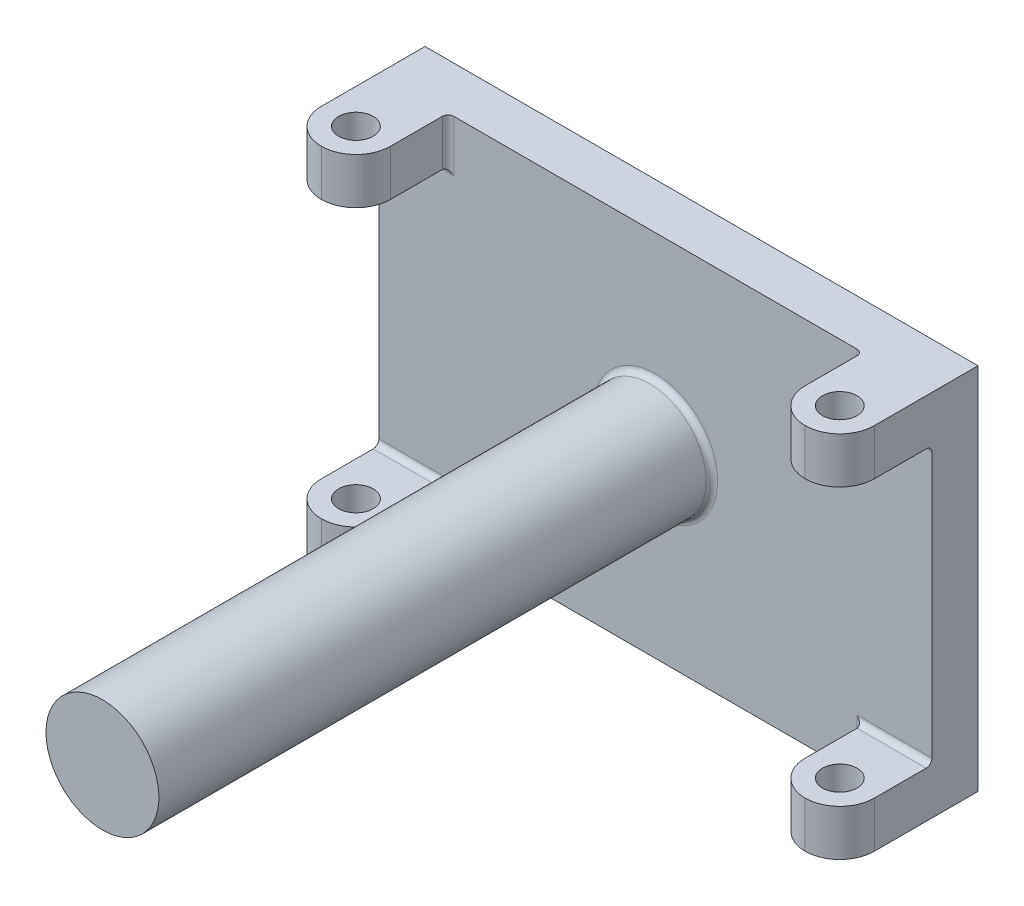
ISO-10303-21;
HEADER;
FILE_DESCRIPTION(('STEP AP214'),'2;1');
FILE_NAME('part.step','',(''),(''),'','','');
FILE_SCHEMA(('AUTOMOTIVE_DESIGN { 1 0 10303 214 1 1 1 1 }'));
ENDSEC;
DATA;
#1=APPLICATION_CONTEXT('core data for automotive mechanical design processes');
#2=APPLICATION_PROTOCOL_DEFINITION('international standard','automotive_design',2000,#1);
#3=PRODUCT_CONTEXT('',#1,'mechanical');
#4=PRODUCT('Part','Part','',(#3));
#5=PRODUCT_RELATED_PRODUCT_CATEGORY('part','',(#4));
#6=PRODUCT_DEFINITION_FORMATION('','',#4);
#7=PRODUCT_DEFINITION_CONTEXT('part definition',#1,'design');
#8=PRODUCT_DEFINITION('design','',#6,#7);
#9=PRODUCT_DEFINITION_SHAPE('','',#8);
#10=(LENGTH_UNIT() NAMED_UNIT(*) SI_UNIT(.MILLI.,.METRE.));
#11=(NAMED_UNIT(*) PLANE_ANGLE_UNIT() SI_UNIT($,.RADIAN.));
#12=(NAMED_UNIT(*) SI_UNIT($,.STERADIAN.) SOLID_ANGLE_UNIT());
#13=UNCERTAINTY_MEASURE_WITH_UNIT(LENGTH_MEASURE(1.E-05),#10,'distance_accuracy_value','');
#14=(GEOMETRIC_REPRESENTATION_CONTEXT(3) GLOBAL_UNCERTAINTY_ASSIGNED_CONTEXT((#13)) GLOBAL_UNIT_ASSIGNED_CONTEXT((#10,
#11,#12)) REPRESENTATION_CONTEXT('',''));
#15=CARTESIAN_POINT('',(0.,0.,0.));
#16=DIRECTION('',(0.,0.,1.));
#17=DIRECTION('',(1.,0.,0.));
#18=AXIS2_PLACEMENT_3D('',#15,#16,#17);
#19=CARTESIAN_POINT('',(-152.4,-101.6,25.4));
#20=DIRECTION('',(0.,0.,-1.));
#21=DIRECTION('',(-1.,0.,0.));
#22=AXIS2_PLACEMENT_3D('',#19,#20,#21);
#23=PLANE('',#22);
#24=CARTESIAN_POINT('',(0.,0.,25.4));
#25=DIRECTION('',(0.,0.,-1.));
#26=DIRECTION('',(-1.,0.,0.));
#27=AXIS2_PLACEMENT_3D('',#24,#25,#26);
#28=CIRCLE('',#27,34.29);
#29=CARTESIAN_POINT('',(-34.29,0.,25.4));
#30=VERTEX_POINT('',#29);
#31=EDGE_CURVE('E386',#30,#30,#28,.T.);
#32=ORIENTED_EDGE('',*,*,#31,.T.);
#33=EDGE_LOOP('',(#32));
#34=FACE_BOUND('',#33,.T.);
#35=DIRECTION('',(0.,1.,0.));
#36=VECTOR('',#35,1.);
#37=CARTESIAN_POINT('',(152.4,-101.6,25.4));
#38=LINE('',#37,#36);
#39=CARTESIAN_POINT('',(152.4,-73.025,25.4));
#40=VERTEX_POINT('',#39);
#41=CARTESIAN_POINT('',(152.4,73.025,25.4));
#42=VERTEX_POINT('',#41);
#43=EDGE_CURVE('E355',#40,#42,#38,.T.);
#44=ORIENTED_EDGE('',*,*,#43,.T.);
#45=DIRECTION('',(1.,0.,0.));
#46=VECTOR('',#45,1.);
#47=CARTESIAN_POINT('',(114.3,73.025,25.4));
#48=LINE('',#47,#46);
#49=CARTESIAN_POINT('',(111.125,73.025,25.4));
#50=VERTEX_POINT('',#49);
#51=EDGE_CURVE('E384',#42,#50,#48,.F.);
#52=ORIENTED_EDGE('',*,*,#51,.T.);
#53=DIRECTION('',(0.,-1.,0.));
#54=VECTOR('',#53,1.);
#55=CARTESIAN_POINT('',(111.125,101.6,25.4));
#56=LINE('',#55,#54);
#57=CARTESIAN_POINT('',(111.125,101.6,25.4));
#58=VERTEX_POINT('',#57);
#59=EDGE_CURVE('E376',#50,#58,#56,.F.);
#60=ORIENTED_EDGE('',*,*,#59,.T.);
#61=DIRECTION('',(-1.,0.,0.));
#62=VECTOR('',#61,1.);
#63=CARTESIAN_POINT('',(-152.4,101.6,25.4));
#64=LINE('',#63,#62);
#65=CARTESIAN_POINT('',(-111.125,101.6,25.4));
#66=VERTEX_POINT('',#65);
#67=EDGE_CURVE('E243',#58,#66,#64,.T.);
#68=ORIENTED_EDGE('',*,*,#67,.T.);
#69=DIRECTION('',(0.,-1.,0.));
#70=VECTOR('',#69,1.);
#71=CARTESIAN_POINT('',(-111.125,-101.6,25.4));
#72=LINE('',#71,#70);
#73=CARTESIAN_POINT('',(-111.125,73.025,25.4));
#74=VERTEX_POINT('',#73);
#75=EDGE_CURVE('E379',#66,#74,#72,.T.);
#76=ORIENTED_EDGE('',*,*,#75,.T.);
#77=DIRECTION('',(-1.,0.,0.));
#78=VECTOR('',#77,1.);
#79=CARTESIAN_POINT('',(-152.4,73.025,25.4));
#80=LINE('',#79,#78);
#81=CARTESIAN_POINT('',(-152.4,73.025,25.4));
#82=VERTEX_POINT('',#81);
#83=EDGE_CURVE('E374',#74,#82,#80,.T.);
#84=ORIENTED_EDGE('',*,*,#83,.T.);
#85=DIRECTION('',(0.,-1.,0.));
#86=VECTOR('',#85,1.);
#87=CARTESIAN_POINT('',(-152.4,-101.6,25.4));
#88=LINE('',#87,#86);
#89=CARTESIAN_POINT('',(-152.4,-73.025,25.4));
#90=VERTEX_POINT('',#89);
#91=EDGE_CURVE('E249',#82,#90,#88,.T.);
#92=ORIENTED_EDGE('',*,*,#91,.T.);
#93=DIRECTION('',(-1.,0.,0.));
#94=VECTOR('',#93,1.);
#95=CARTESIAN_POINT('',(-114.3,-73.025,25.4));
#96=LINE('',#95,#94);
#97=CARTESIAN_POINT('',(-111.125,-73.025,25.4));
#98=VERTEX_POINT('',#97);
#99=EDGE_CURVE('E468',#90,#98,#96,.F.);
#100=ORIENTED_EDGE('',*,*,#99,.T.);
#101=DIRECTION('',(0.,1.,0.));
#102=VECTOR('',#101,1.);
#103=CARTESIAN_POINT('',(-111.125,-101.6,25.4));
#104=LINE('',#103,#102);
#105=CARTESIAN_POINT('',(-111.125,-101.6,25.4));
#106=VERTEX_POINT('',#105);
#107=EDGE_CURVE('E344',#98,#106,#104,.F.);
#108=ORIENTED_EDGE('',*,*,#107,.T.);
#109=DIRECTION('',(1.,0.,0.));
#110=VECTOR('',#109,1.);
#111=CARTESIAN_POINT('',(-152.4,-101.6,25.4));
#112=LINE('',#111,#110);
#113=CARTESIAN_POINT('',(111.125,-101.6,25.4));
#114=VERTEX_POINT('',#113);
#115=EDGE_CURVE('E348',#106,#114,#112,.T.);
#116=ORIENTED_EDGE('',*,*,#115,.T.);
#117=DIRECTION('',(0.,1.,0.));
#118=VECTOR('',#117,1.);
#119=CARTESIAN_POINT('',(111.125,-101.6,25.4));
#120=LINE('',#119,#118);
#121=CARTESIAN_POINT('',(111.125,-73.025,25.4));
#122=VERTEX_POINT('',#121);
#123=EDGE_CURVE('E364',#114,#122,#120,.T.);
#124=ORIENTED_EDGE('',*,*,#123,.T.);
#125=DIRECTION('',(1.,0.,0.));
#126=VECTOR('',#125,1.);
#127=CARTESIAN_POINT('',(-152.4,-73.025,25.4));
#128=LINE('',#127,#126);
#129=EDGE_CURVE('E373',#122,#40,#128,.T.);
#130=ORIENTED_EDGE('',*,*,#129,.T.);
#131=EDGE_LOOP('',(#44,#52,#60,#68,#76,#84,#92,#100,#108,#116,#124,#130));
#132=FACE_BOUND('',#131,.T.);
#133=ADVANCED_FACE('F34',(#34,#132),#23,.F.);
#134=CARTESIAN_POINT('',(-152.4,101.6,25.4));
#135=DIRECTION('',(0.,-1.,0.));
#136=DIRECTION('',(1.,0.,0.));
#137=AXIS2_PLACEMENT_3D('',#134,#135,#136);
#138=PLANE('',#137);
#139=CARTESIAN_POINT('',(133.35,101.6,57.15));
#140=DIRECTION('',(0.,1.,0.));
#141=DIRECTION('',(-1.,0.,0.));
#142=AXIS2_PLACEMENT_3D('',#139,#140,#141);
#143=CIRCLE('',#142,9.52500000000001);
#144=CARTESIAN_POINT('',(123.825,101.6,57.15));
#145=VERTEX_POINT('',#144);
#146=EDGE_CURVE('E341',#145,#145,#143,.T.);
#147=ORIENTED_EDGE('',*,*,#146,.F.);
#148=EDGE_LOOP('',(#147));
#149=FACE_BOUND('',#148,.T.);
#150=DIRECTION('',(0.,0.,-1.));
#151=VECTOR('',#150,1.);
#152=CARTESIAN_POINT('',(114.3,101.6,76.2));
#153=LINE('',#152,#151);
#154=CARTESIAN_POINT('',(114.3,101.6,57.15));
#155=VERTEX_POINT('',#154);
#156=CARTESIAN_POINT('',(114.3,101.6,28.575));
#157=VERTEX_POINT('',#156);
#158=EDGE_CURVE('E449',#155,#157,#153,.T.);
#159=ORIENTED_EDGE('',*,*,#158,.F.);
#160=CARTESIAN_POINT('',(133.35,101.6,57.15));
#161=DIRECTION('',(0.,-1.,0.));
#162=DIRECTION('',(1.,0.,0.));
#163=AXIS2_PLACEMENT_3D('',#160,#161,#162);
#164=CIRCLE('',#163,19.05);
#165=CARTESIAN_POINT('',(133.35,101.6,76.2));
#166=VERTEX_POINT('',#165);
#167=EDGE_CURVE('E329',#155,#166,#164,.F.);
#168=ORIENTED_EDGE('',*,*,#167,.T.);
#169=CARTESIAN_POINT('',(133.35,101.6,57.15));
#170=DIRECTION('',(0.,-1.,0.));
#171=DIRECTION('',(1.,0.,0.));
#172=AXIS2_PLACEMENT_3D('',#169,#170,#171);
#173=CIRCLE('',#172,19.05);
#174=CARTESIAN_POINT('',(152.4,101.6,57.15));
#175=VERTEX_POINT('',#174);
#176=EDGE_CURVE('E327',#166,#175,#173,.F.);
#177=ORIENTED_EDGE('',*,*,#176,.T.);
#178=DIRECTION('',(0.,0.,-1.));
#179=VECTOR('',#178,1.);
#180=CARTESIAN_POINT('',(152.4,101.6,25.4));
#181=LINE('',#180,#179);
#182=CARTESIAN_POINT('',(152.4,101.6,0.));
#183=VERTEX_POINT('',#182);
#184=EDGE_CURVE('E251',#175,#183,#181,.T.);
#185=ORIENTED_EDGE('',*,*,#184,.T.);
#186=DIRECTION('',(-1.,0.,0.));
#187=VECTOR('',#186,1.);
#188=CARTESIAN_POINT('',(-152.4,101.6,0.));
#189=LINE('',#188,#187);
#190=CARTESIAN_POINT('',(-152.4,101.6,0.));
#191=VERTEX_POINT('',#190);
#192=EDGE_CURVE('E247',#183,#191,#189,.T.);
#193=ORIENTED_EDGE('',*,*,#192,.T.);
#194=DIRECTION('',(0.,0.,-1.));
#195=VECTOR('',#194,1.);
#196=CARTESIAN_POINT('',(-152.4,101.6,25.4));
#197=LINE('',#196,#195);
#198=CARTESIAN_POINT('',(-152.4,101.6,57.15));
#199=VERTEX_POINT('',#198);
#200=EDGE_CURVE('E236',#199,#191,#197,.T.);
#201=ORIENTED_EDGE('',*,*,#200,.F.);
#202=CARTESIAN_POINT('',(-133.35,101.6,57.15));
#203=DIRECTION('',(0.,-1.,0.));
#204=DIRECTION('',(1.,0.,0.));
#205=AXIS2_PLACEMENT_3D('',#202,#203,#204);
#206=CIRCLE('',#205,19.05);
#207=CARTESIAN_POINT('',(-133.35,101.6,76.2));
#208=VERTEX_POINT('',#207);
#209=EDGE_CURVE('E306',#199,#208,#206,.F.);
#210=ORIENTED_EDGE('',*,*,#209,.T.);
#211=CARTESIAN_POINT('',(-133.35,101.6,57.15));
#212=DIRECTION('',(0.,-1.,0.));
#213=DIRECTION('',(1.,0.,0.));
#214=AXIS2_PLACEMENT_3D('',#211,#212,#213);
#215=CIRCLE('',#214,19.05);
#216=CARTESIAN_POINT('',(-114.3,101.6,57.15));
#217=VERTEX_POINT('',#216);
#218=EDGE_CURVE('E308',#208,#217,#215,.F.);
#219=ORIENTED_EDGE('',*,*,#218,.T.);
#220=DIRECTION('',(0.,0.,-1.));
#221=VECTOR('',#220,1.);
#222=CARTESIAN_POINT('',(-114.3,101.6,76.2));
#223=LINE('',#222,#221);
#224=CARTESIAN_POINT('',(-114.3,101.6,28.575));
#225=VERTEX_POINT('',#224);
#226=EDGE_CURVE('E316',#217,#225,#223,.T.);
#227=ORIENTED_EDGE('',*,*,#226,.T.);
#228=CARTESIAN_POINT('',(-111.125,101.6,28.575));
#229=DIRECTION('',(0.,-1.,0.));
#230=DIRECTION('',(1.,0.,0.));
#231=AXIS2_PLACEMENT_3D('',#228,#229,#230);
#232=CIRCLE('',#231,3.175);
#233=EDGE_CURVE('E43',#225,#66,#232,.T.);
#234=ORIENTED_EDGE('',*,*,#233,.T.);
#235=ORIENTED_EDGE('',*,*,#67,.F.);
#236=CARTESIAN_POINT('',(111.125,101.6,28.575));
#237=DIRECTION('',(0.,-1.,0.));
#238=DIRECTION('',(1.,0.,0.));
#239=AXIS2_PLACEMENT_3D('',#236,#237,#238);
#240=CIRCLE('',#239,3.175);
#241=EDGE_CURVE('E414',#58,#157,#240,.T.);
#242=ORIENTED_EDGE('',*,*,#241,.T.);
#243=EDGE_LOOP('',(#159,#168,#177,#185,#193,#201,#210,#219,#227,#234,#235,#242));
#244=FACE_BOUND('',#243,.T.);
#245=CARTESIAN_POINT('',(-133.35,101.6,57.15));
#246=DIRECTION('',(0.,-1.,0.));
#247=DIRECTION('',(1.,0.,0.));
#248=AXIS2_PLACEMENT_3D('',#245,#246,#247);
#249=CIRCLE('',#248,9.52500000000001);
#250=CARTESIAN_POINT('',(-123.825,101.6,57.15));
#251=VERTEX_POINT('',#250);
#252=EDGE_CURVE('E320',#251,#251,#249,.T.);
#253=ORIENTED_EDGE('',*,*,#252,.T.);
#254=EDGE_LOOP('',(#253));
#255=FACE_BOUND('',#254,.T.);
#256=ADVANCED_FACE('F460',(#149,#244,#255),#138,.F.);
#257=CARTESIAN_POINT('',(-152.4,76.2,76.2));
#258=DIRECTION('',(0.,-1.,0.));
#259=DIRECTION('',(0.,0.,-1.));
#260=AXIS2_PLACEMENT_3D('',#257,#258,#259);
#261=PLANE('',#260);
#262=DIRECTION('',(0.,0.,-1.));
#263=VECTOR('',#262,1.);
#264=CARTESIAN_POINT('',(-152.4,76.2,76.2));
#265=LINE('',#264,#263);
#266=CARTESIAN_POINT('',(-152.4,76.2,57.15));
#267=VERTEX_POINT('',#266);
#268=CARTESIAN_POINT('',(-152.4,76.2,28.575));
#269=VERTEX_POINT('',#268);
#270=EDGE_CURVE('E558',#267,#269,#265,.T.);
#271=ORIENTED_EDGE('',*,*,#270,.T.);
#272=DIRECTION('',(-1.,0.,0.));
#273=VECTOR('',#272,1.);
#274=CARTESIAN_POINT('',(-152.4,76.2,28.575));
#275=LINE('',#274,#273);
#276=CARTESIAN_POINT('',(-114.3,76.2,28.575));
#277=VERTEX_POINT('',#276);
#278=EDGE_CURVE('E392',#269,#277,#275,.F.);
#279=ORIENTED_EDGE('',*,*,#278,.T.);
#280=DIRECTION('',(0.,0.,-1.));
#281=VECTOR('',#280,1.);
#282=CARTESIAN_POINT('',(-114.3,76.2,76.2));
#283=LINE('',#282,#281);
#284=CARTESIAN_POINT('',(-114.3,76.2,57.15));
#285=VERTEX_POINT('',#284);
#286=EDGE_CURVE('E561',#285,#277,#283,.T.);
#287=ORIENTED_EDGE('',*,*,#286,.F.);
#288=CARTESIAN_POINT('',(-133.35,76.2,57.15));
#289=DIRECTION('',(0.,-1.,0.));
#290=DIRECTION('',(0.,0.,-1.));
#291=AXIS2_PLACEMENT_3D('',#288,#289,#290);
#292=CIRCLE('',#291,19.05);
#293=CARTESIAN_POINT('',(-133.35,76.2,76.2));
#294=VERTEX_POINT('',#293);
#295=EDGE_CURVE('E304',#285,#294,#292,.T.);
#296=ORIENTED_EDGE('',*,*,#295,.T.);
#297=CARTESIAN_POINT('',(-133.35,76.2,57.15));
#298=DIRECTION('',(0.,-1.,0.));
#299=DIRECTION('',(0.,0.,-1.));
#300=AXIS2_PLACEMENT_3D('',#297,#298,#299);
#301=CIRCLE('',#300,19.05);
#302=EDGE_CURVE('E302',#294,#267,#301,.T.);
#303=ORIENTED_EDGE('',*,*,#302,.T.);
#304=EDGE_LOOP('',(#271,#279,#287,#296,#303));
#305=FACE_BOUND('',#304,.T.);
#306=CARTESIAN_POINT('',(-133.35,76.2,57.15));
#307=DIRECTION('',(0.,-1.,0.));
#308=DIRECTION('',(0.,0.,-1.));
#309=AXIS2_PLACEMENT_3D('',#306,#307,#308);
#310=CIRCLE('',#309,9.52500000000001);
#311=CARTESIAN_POINT('',(-133.35,76.2,47.625));
#312=VERTEX_POINT('',#311);
#313=EDGE_CURVE('E317',#312,#312,#310,.F.);
#314=ORIENTED_EDGE('',*,*,#313,.T.);
#315=EDGE_LOOP('',(#314));
#316=FACE_BOUND('',#315,.T.);
#317=ADVANCED_FACE('F512',(#305,#316),#261,.T.);
#318=CARTESIAN_POINT('',(-152.4,-101.6,25.4));
#319=DIRECTION('',(0.,1.,0.));
#320=DIRECTION('',(-1.,0.,0.));
#321=AXIS2_PLACEMENT_3D('',#318,#319,#320);
#322=PLANE('',#321);
#323=CARTESIAN_POINT('',(133.35,-101.6,57.15));
#324=DIRECTION('',(0.,1.,0.));
#325=DIRECTION('',(-1.,0.,0.));
#326=AXIS2_PLACEMENT_3D('',#323,#324,#325);
#327=CIRCLE('',#326,19.05);
#328=CARTESIAN_POINT('',(152.4,-101.6,57.15));
#329=VERTEX_POINT('',#328);
#330=CARTESIAN_POINT('',(133.35,-101.6,76.2));
#331=VERTEX_POINT('',#330);
#332=EDGE_CURVE('E285',#329,#331,#327,.F.);
#333=ORIENTED_EDGE('',*,*,#332,.T.);
#334=CARTESIAN_POINT('',(133.35,-101.6,57.15));
#335=DIRECTION('',(0.,1.,0.));
#336=DIRECTION('',(-1.,0.,0.));
#337=AXIS2_PLACEMENT_3D('',#334,#335,#336);
#338=CIRCLE('',#337,19.05);
#339=CARTESIAN_POINT('',(114.3,-101.6,57.15));
#340=VERTEX_POINT('',#339);
#341=EDGE_CURVE('E287',#331,#340,#338,.F.);
#342=ORIENTED_EDGE('',*,*,#341,.T.);
#343=DIRECTION('',(0.,0.,-1.));
#344=VECTOR('',#343,1.);
#345=CARTESIAN_POINT('',(114.3,-101.6,76.2));
#346=LINE('',#345,#344);
#347=CARTESIAN_POINT('',(114.3,-101.6,28.575));
#348=VERTEX_POINT('',#347);
#349=EDGE_CURVE('E295',#340,#348,#346,.T.);
#350=ORIENTED_EDGE('',*,*,#349,.T.);
#351=CARTESIAN_POINT('',(111.125,-101.6,28.575));
#352=DIRECTION('',(0.,1.,0.));
#353=DIRECTION('',(-1.,0.,0.));
#354=AXIS2_PLACEMENT_3D('',#351,#352,#353);
#355=CIRCLE('',#354,3.175);
#356=EDGE_CURVE('E370',#348,#114,#355,.T.);
#357=ORIENTED_EDGE('',*,*,#356,.T.);
#358=ORIENTED_EDGE('',*,*,#115,.F.);
#359=CARTESIAN_POINT('',(-111.125,-101.6,28.575));
#360=DIRECTION('',(0.,1.,0.));
#361=DIRECTION('',(-1.,0.,0.));
#362=AXIS2_PLACEMENT_3D('',#359,#360,#361);
#363=CIRCLE('',#362,3.175);
#364=CARTESIAN_POINT('',(-114.3,-101.6,28.575));
#365=VERTEX_POINT('',#364);
#366=EDGE_CURVE('E11',#106,#365,#363,.T.);
#367=ORIENTED_EDGE('',*,*,#366,.T.);
#368=DIRECTION('',(0.,0.,-1.));
#369=VECTOR('',#368,1.);
#370=CARTESIAN_POINT('',(-114.3,-101.6,76.2));
#371=LINE('',#370,#369);
#372=CARTESIAN_POINT('',(-114.3,-101.6,57.15));
#373=VERTEX_POINT('',#372);
#374=EDGE_CURVE('E238',#373,#365,#371,.T.);
#375=ORIENTED_EDGE('',*,*,#374,.F.);
#376=CARTESIAN_POINT('',(-133.35,-101.6,57.15));
#377=DIRECTION('',(0.,1.,0.));
#378=DIRECTION('',(-1.,0.,0.));
#379=AXIS2_PLACEMENT_3D('',#376,#377,#378);
#380=CIRCLE('',#379,19.05);
#381=CARTESIAN_POINT('',(-133.35,-101.6,76.2));
#382=VERTEX_POINT('',#381);
#383=EDGE_CURVE('E266',#373,#382,#380,.F.);
#384=ORIENTED_EDGE('',*,*,#383,.T.);
#385=CARTESIAN_POINT('',(-133.35,-101.6,57.15));
#386=DIRECTION('',(0.,1.,0.));
#387=DIRECTION('',(-1.,0.,0.));
#388=AXIS2_PLACEMENT_3D('',#385,#386,#387);
#389=CIRCLE('',#388,19.05);
#390=CARTESIAN_POINT('',(-152.4,-101.6,57.15));
#391=VERTEX_POINT('',#390);
#392=EDGE_CURVE('E218',#382,#391,#389,.F.);
#393=ORIENTED_EDGE('',*,*,#392,.T.);
#394=DIRECTION('',(0.,0.,-1.));
#395=VECTOR('',#394,1.);
#396=CARTESIAN_POINT('',(-152.4,-101.6,25.4));
#397=LINE('',#396,#395);
#398=CARTESIAN_POINT('',(-152.4,-101.6,0.));
#399=VERTEX_POINT('',#398);
#400=EDGE_CURVE('E210',#391,#399,#397,.T.);
#401=ORIENTED_EDGE('',*,*,#400,.T.);
#402=DIRECTION('',(1.,0.,0.));
#403=VECTOR('',#402,1.);
#404=CARTESIAN_POINT('',(-152.4,-101.6,0.));
#405=LINE('',#404,#403);
#406=CARTESIAN_POINT('',(152.4,-101.6,0.));
#407=VERTEX_POINT('',#406);
#408=EDGE_CURVE('E215',#399,#407,#405,.T.);
#409=ORIENTED_EDGE('',*,*,#408,.T.);
#410=DIRECTION('',(0.,0.,-1.));
#411=VECTOR('',#410,1.);
#412=CARTESIAN_POINT('',(152.4,-101.6,25.4));
#413=LINE('',#412,#411);
#414=EDGE_CURVE('E223',#329,#407,#413,.T.);
#415=ORIENTED_EDGE('',*,*,#414,.F.);
#416=EDGE_LOOP('',(#333,#342,#350,#357,#358,#367,#375,#384,#393,#401,#409,#415));
#417=FACE_BOUND('',#416,.T.);
#418=CARTESIAN_POINT('',(-133.35,-101.6,57.15));
#419=DIRECTION('',(0.,-1.,0.));
#420=DIRECTION('',(1.,0.,0.));
#421=AXIS2_PLACEMENT_3D('',#418,#419,#420);
#422=CIRCLE('',#421,9.52500000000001);
#423=CARTESIAN_POINT('',(-123.825,-101.6,57.15));
#424=VERTEX_POINT('',#423);
#425=EDGE_CURVE('E278',#424,#424,#422,.T.);
#426=ORIENTED_EDGE('',*,*,#425,.F.);
#427=EDGE_LOOP('',(#426));
#428=FACE_BOUND('',#427,.T.);
#429=CARTESIAN_POINT('',(133.35,-101.6,57.15));
#430=DIRECTION('',(0.,1.,0.));
#431=DIRECTION('',(-1.,0.,0.));
#432=AXIS2_PLACEMENT_3D('',#429,#430,#431);
#433=CIRCLE('',#432,9.52500000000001);
#434=CARTESIAN_POINT('',(123.825,-101.6,57.15));
#435=VERTEX_POINT('',#434);
#436=EDGE_CURVE('E299',#435,#435,#433,.T.);
#437=ORIENTED_EDGE('',*,*,#436,.T.);
#438=EDGE_LOOP('',(#437));
#439=FACE_BOUND('',#438,.T.);
#440=ADVANCED_FACE('F212',(#417,#428,#439),#322,.F.);
#441=CARTESIAN_POINT('',(152.4,-76.2,76.2));
#442=DIRECTION('',(0.,1.,0.));
#443=DIRECTION('',(0.,0.,1.));
#444=AXIS2_PLACEMENT_3D('',#441,#442,#443);
#445=PLANE('',#444);
#446=DIRECTION('',(0.,0.,-1.));
#447=VECTOR('',#446,1.);
#448=CARTESIAN_POINT('',(152.4,-76.2,76.2));
#449=LINE('',#448,#447);
#450=CARTESIAN_POINT('',(152.4,-76.2,57.15));
#451=VERTEX_POINT('',#450);
#452=CARTESIAN_POINT('',(152.4,-76.2,28.575));
#453=VERTEX_POINT('',#452);
#454=EDGE_CURVE('E548',#451,#453,#449,.T.);
#455=ORIENTED_EDGE('',*,*,#454,.T.);
#456=DIRECTION('',(1.,0.,0.));
#457=VECTOR('',#456,1.);
#458=CARTESIAN_POINT('',(152.4,-76.2,28.575));
#459=LINE('',#458,#457);
#460=CARTESIAN_POINT('',(114.3,-76.2,28.575));
#461=VERTEX_POINT('',#460);
#462=EDGE_CURVE('E397',#453,#461,#459,.F.);
#463=ORIENTED_EDGE('',*,*,#462,.T.);
#464=DIRECTION('',(0.,0.,-1.));
#465=VECTOR('',#464,1.);
#466=CARTESIAN_POINT('',(114.3,-76.2,76.2));
#467=LINE('',#466,#465);
#468=CARTESIAN_POINT('',(114.3,-76.2,57.15));
#469=VERTEX_POINT('',#468);
#470=EDGE_CURVE('E549',#469,#461,#467,.T.);
#471=ORIENTED_EDGE('',*,*,#470,.F.);
#472=CARTESIAN_POINT('',(133.35,-76.2,57.15));
#473=DIRECTION('',(0.,1.,0.));
#474=DIRECTION('',(0.,0.,1.));
#475=AXIS2_PLACEMENT_3D('',#472,#473,#474);
#476=CIRCLE('',#475,19.05);
#477=CARTESIAN_POINT('',(133.35,-76.2,76.2));
#478=VERTEX_POINT('',#477);
#479=EDGE_CURVE('E283',#469,#478,#476,.T.);
#480=ORIENTED_EDGE('',*,*,#479,.T.);
#481=CARTESIAN_POINT('',(133.35,-76.2,57.15));
#482=DIRECTION('',(0.,1.,0.));
#483=DIRECTION('',(0.,0.,1.));
#484=AXIS2_PLACEMENT_3D('',#481,#482,#483);
#485=CIRCLE('',#484,19.05);
#486=EDGE_CURVE('E281',#478,#451,#485,.T.);
#487=ORIENTED_EDGE('',*,*,#486,.T.);
#488=EDGE_LOOP('',(#455,#463,#471,#480,#487));
#489=FACE_BOUND('',#488,.T.);
#490=CARTESIAN_POINT('',(133.35,-76.2,57.15));
#491=DIRECTION('',(0.,1.,0.));
#492=DIRECTION('',(0.,0.,1.));
#493=AXIS2_PLACEMENT_3D('',#490,#491,#492);
#494=CIRCLE('',#493,9.52500000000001);
#495=CARTESIAN_POINT('',(133.35,-76.2,66.675));
#496=VERTEX_POINT('',#495);
#497=EDGE_CURVE('E296',#496,#496,#494,.F.);
#498=ORIENTED_EDGE('',*,*,#497,.T.);
#499=EDGE_LOOP('',(#498));
#500=FACE_BOUND('',#499,.T.);
#501=ADVANCED_FACE('F523',(#489,#500),#445,.T.);
#502=CARTESIAN_POINT('',(-152.4,-101.6,25.4));
#503=DIRECTION('',(1.,0.,0.));
#504=DIRECTION('',(0.,0.,-1.));
#505=AXIS2_PLACEMENT_3D('',#502,#503,#504);
#506=PLANE('',#505);
#507=ORIENTED_EDGE('',*,*,#270,.F.);
#508=DIRECTION('',(0.,1.,0.));
#509=VECTOR('',#508,1.);
#510=CARTESIAN_POINT('',(-152.4,-101.6,57.15));
#511=LINE('',#510,#509);
#512=EDGE_CURVE('E310',#267,#199,#511,.T.);
#513=ORIENTED_EDGE('',*,*,#512,.T.);
#514=ORIENTED_EDGE('',*,*,#200,.T.);
#515=DIRECTION('',(0.,-1.,0.));
#516=VECTOR('',#515,1.);
#517=CARTESIAN_POINT('',(-152.4,-101.6,0.));
#518=LINE('',#517,#516);
#519=EDGE_CURVE('E229',#191,#399,#518,.T.);
#520=ORIENTED_EDGE('',*,*,#519,.T.);
#521=ORIENTED_EDGE('',*,*,#400,.F.);
#522=DIRECTION('',(0.,-1.,0.));
#523=VECTOR('',#522,1.);
#524=CARTESIAN_POINT('',(-152.4,-101.6,57.15));
#525=LINE('',#524,#523);
#526=CARTESIAN_POINT('',(-152.4,-76.2,57.15));
#527=VERTEX_POINT('',#526);
#528=EDGE_CURVE('E268',#391,#527,#525,.F.);
#529=ORIENTED_EDGE('',*,*,#528,.T.);
#530=DIRECTION('',(0.,0.,-1.));
#531=VECTOR('',#530,1.);
#532=CARTESIAN_POINT('',(-152.4,-76.2,76.2));
#533=LINE('',#532,#531);
#534=CARTESIAN_POINT('',(-152.4,-76.2,28.575));
#535=VERTEX_POINT('',#534);
#536=EDGE_CURVE('E274',#527,#535,#533,.T.);
#537=ORIENTED_EDGE('',*,*,#536,.T.);
#538=CARTESIAN_POINT('',(-152.4,-73.025,28.575));
#539=DIRECTION('',(1.,0.,0.));
#540=DIRECTION('',(0.,0.,-1.));
#541=AXIS2_PLACEMENT_3D('',#538,#539,#540);
#542=CIRCLE('',#541,3.175);
#543=EDGE_CURVE('E406',#535,#90,#542,.T.);
#544=ORIENTED_EDGE('',*,*,#543,.T.);
#545=ORIENTED_EDGE('',*,*,#91,.F.);
#546=CARTESIAN_POINT('',(-152.4,73.025,28.575));
#547=DIRECTION('',(1.,0.,0.));
#548=DIRECTION('',(0.,0.,-1.));
#549=AXIS2_PLACEMENT_3D('',#546,#547,#548);
#550=CIRCLE('',#549,3.175);
#551=EDGE_CURVE('E408',#82,#269,#550,.T.);
#552=ORIENTED_EDGE('',*,*,#551,.T.);
#553=EDGE_LOOP('',(#507,#513,#514,#520,#521,#529,#537,#544,#545,#552));
#554=FACE_BOUND('',#553,.T.);
#555=ADVANCED_FACE('F234',(#554),#506,.F.);
#556=CARTESIAN_POINT('',(152.4,-101.6,25.4));
#557=DIRECTION('',(-1.,0.,0.));
#558=DIRECTION('',(0.,0.,1.));
#559=AXIS2_PLACEMENT_3D('',#556,#557,#558);
#560=PLANE('',#559);
#561=ORIENTED_EDGE('',*,*,#184,.F.);
#562=DIRECTION('',(0.,1.,0.));
#563=VECTOR('',#562,1.);
#564=CARTESIAN_POINT('',(152.4,-101.6,57.15));
#565=LINE('',#564,#563);
#566=CARTESIAN_POINT('',(152.4,76.2,57.15));
#567=VERTEX_POINT('',#566);
#568=EDGE_CURVE('E331',#175,#567,#565,.F.);
#569=ORIENTED_EDGE('',*,*,#568,.T.);
#570=DIRECTION('',(0.,0.,-1.));
#571=VECTOR('',#570,1.);
#572=CARTESIAN_POINT('',(152.4,76.2,76.2));
#573=LINE('',#572,#571);
#574=CARTESIAN_POINT('',(152.4,76.2,28.575));
#575=VERTEX_POINT('',#574);
#576=EDGE_CURVE('E337',#567,#575,#573,.T.);
#577=ORIENTED_EDGE('',*,*,#576,.T.);
#578=CARTESIAN_POINT('',(152.4,73.025,28.575));
#579=DIRECTION('',(-1.,0.,0.));
#580=DIRECTION('',(0.,0.,1.));
#581=AXIS2_PLACEMENT_3D('',#578,#579,#580);
#582=CIRCLE('',#581,3.175);
#583=EDGE_CURVE('E410',#575,#42,#582,.T.);
#584=ORIENTED_EDGE('',*,*,#583,.T.);
#585=ORIENTED_EDGE('',*,*,#43,.F.);
#586=CARTESIAN_POINT('',(152.4,-73.025,28.575));
#587=DIRECTION('',(-1.,0.,0.));
#588=DIRECTION('',(0.,0.,1.));
#589=AXIS2_PLACEMENT_3D('',#586,#587,#588);
#590=CIRCLE('',#589,3.175);
#591=EDGE_CURVE('E412',#40,#453,#590,.T.);
#592=ORIENTED_EDGE('',*,*,#591,.T.);
#593=ORIENTED_EDGE('',*,*,#454,.F.);
#594=DIRECTION('',(0.,-1.,0.));
#595=VECTOR('',#594,1.);
#596=CARTESIAN_POINT('',(152.4,-101.6,57.15));
#597=LINE('',#596,#595);
#598=EDGE_CURVE('E289',#451,#329,#597,.T.);
#599=ORIENTED_EDGE('',*,*,#598,.T.);
#600=ORIENTED_EDGE('',*,*,#414,.T.);
#601=DIRECTION('',(0.,1.,0.));
#602=VECTOR('',#601,1.);
#603=CARTESIAN_POINT('',(152.4,-101.6,0.));
#604=LINE('',#603,#602);
#605=EDGE_CURVE('E231',#407,#183,#604,.T.);
#606=ORIENTED_EDGE('',*,*,#605,.T.);
#607=EDGE_LOOP('',(#561,#569,#577,#584,#585,#592,#593,#599,#600,#606));
#608=FACE_BOUND('',#607,.T.);
#609=ADVANCED_FACE('F434',(#608),#560,.F.);
#610=CARTESIAN_POINT('',(-152.4,-101.6,0.));
#611=DIRECTION('',(0.,0.,-1.));
#612=DIRECTION('',(-1.,0.,0.));
#613=AXIS2_PLACEMENT_3D('',#610,#611,#612);
#614=PLANE('',#613);
#615=ORIENTED_EDGE('',*,*,#519,.F.);
#616=ORIENTED_EDGE('',*,*,#192,.F.);
#617=ORIENTED_EDGE('',*,*,#605,.F.);
#618=ORIENTED_EDGE('',*,*,#408,.F.);
#619=EDGE_LOOP('',(#615,#616,#617,#618));
#620=FACE_BOUND('',#619,.T.);
#621=ADVANCED_FACE('F227',(#620),#614,.T.);
#622=CARTESIAN_POINT('',(-114.3,-101.6,76.2));
#623=DIRECTION('',(-1.,0.,0.));
#624=DIRECTION('',(0.,0.,1.));
#625=AXIS2_PLACEMENT_3D('',#622,#623,#624);
#626=PLANE('',#625);
#627=ORIENTED_EDGE('',*,*,#374,.T.);
#628=DIRECTION('',(0.,1.,0.));
#629=VECTOR('',#628,1.);
#630=CARTESIAN_POINT('',(-114.3,-76.2,28.575));
#631=LINE('',#630,#629);
#632=CARTESIAN_POINT('',(-114.3,-76.2,28.575));
#633=VERTEX_POINT('',#632);
#634=EDGE_CURVE('E404',#365,#633,#631,.T.);
#635=ORIENTED_EDGE('',*,*,#634,.T.);
#636=DIRECTION('',(0.,0.,-1.));
#637=VECTOR('',#636,1.);
#638=CARTESIAN_POINT('',(-114.3,-76.2,76.2));
#639=LINE('',#638,#637);
#640=CARTESIAN_POINT('',(-114.3,-76.2,57.15));
#641=VERTEX_POINT('',#640);
#642=EDGE_CURVE('E240',#641,#633,#639,.T.);
#643=ORIENTED_EDGE('',*,*,#642,.F.);
#644=DIRECTION('',(0.,1.,0.));
#645=VECTOR('',#644,1.);
#646=CARTESIAN_POINT('',(-114.3,-101.6,57.15));
#647=LINE('',#646,#645);
#648=EDGE_CURVE('E262',#641,#373,#647,.F.);
#649=ORIENTED_EDGE('',*,*,#648,.T.);
#650=EDGE_LOOP('',(#627,#635,#643,#649));
#651=FACE_BOUND('',#650,.T.);
#652=ADVANCED_FACE('F491',(#651),#626,.F.);
#653=CARTESIAN_POINT('',(-152.4,-76.2,76.2));
#654=DIRECTION('',(0.,-1.,0.));
#655=DIRECTION('',(0.,0.,-1.));
#656=AXIS2_PLACEMENT_3D('',#653,#654,#655);
#657=PLANE('',#656);
#658=CARTESIAN_POINT('',(-133.35,-76.2,57.15));
#659=DIRECTION('',(0.,-1.,0.));
#660=DIRECTION('',(0.,0.,-1.));
#661=AXIS2_PLACEMENT_3D('',#658,#659,#660);
#662=CIRCLE('',#661,9.52500000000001);
#663=CARTESIAN_POINT('',(-133.35,-76.2,47.625));
#664=VERTEX_POINT('',#663);
#665=EDGE_CURVE('E275',#664,#664,#662,.T.);
#666=ORIENTED_EDGE('',*,*,#665,.T.);
#667=EDGE_LOOP('',(#666));
#668=FACE_BOUND('',#667,.T.);
#669=ORIENTED_EDGE('',*,*,#642,.T.);
#670=DIRECTION('',(-1.,0.,0.));
#671=VECTOR('',#670,1.);
#672=CARTESIAN_POINT('',(-152.4,-76.2,28.575));
#673=LINE('',#672,#671);
#674=EDGE_CURVE('E389',#633,#535,#673,.T.);
#675=ORIENTED_EDGE('',*,*,#674,.T.);
#676=ORIENTED_EDGE('',*,*,#536,.F.);
#677=CARTESIAN_POINT('',(-133.35,-76.2,57.15));
#678=DIRECTION('',(0.,-1.,0.));
#679=DIRECTION('',(0.,0.,-1.));
#680=AXIS2_PLACEMENT_3D('',#677,#678,#679);
#681=CIRCLE('',#680,19.05);
#682=CARTESIAN_POINT('',(-133.35,-76.2,76.2));
#683=VERTEX_POINT('',#682);
#684=EDGE_CURVE('E222',#527,#683,#681,.F.);
#685=ORIENTED_EDGE('',*,*,#684,.T.);
#686=CARTESIAN_POINT('',(-133.35,-76.2,57.15));
#687=DIRECTION('',(0.,-1.,0.));
#688=DIRECTION('',(0.,0.,-1.));
#689=AXIS2_PLACEMENT_3D('',#686,#687,#688);
#690=CIRCLE('',#689,19.05);
#691=EDGE_CURVE('E260',#683,#641,#690,.F.);
#692=ORIENTED_EDGE('',*,*,#691,.T.);
#693=EDGE_LOOP('',(#669,#675,#676,#685,#692));
#694=FACE_BOUND('',#693,.T.);
#695=ADVANCED_FACE('F483',(#668,#694),#657,.F.);
#696=CARTESIAN_POINT('',(-133.35,-76.2,57.15));
#697=DIRECTION('',(0.,-1.,0.));
#698=DIRECTION('',(0.,0.,-1.));
#699=AXIS2_PLACEMENT_3D('',#696,#697,#698);
#700=CYLINDRICAL_SURFACE('',#699,19.05);
#701=ORIENTED_EDGE('',*,*,#528,.F.);
#702=ORIENTED_EDGE('',*,*,#392,.F.);
#703=DIRECTION('',(0.,-1.,0.));
#704=VECTOR('',#703,1.);
#705=CARTESIAN_POINT('',(-133.35,-76.2,76.2));
#706=LINE('',#705,#704);
#707=EDGE_CURVE('E271',#683,#382,#706,.T.);
#708=ORIENTED_EDGE('',*,*,#707,.F.);
#709=ORIENTED_EDGE('',*,*,#684,.F.);
#710=EDGE_LOOP('',(#701,#702,#708,#709));
#711=FACE_BOUND('',#710,.T.);
#712=ADVANCED_FACE('F494',(#711),#700,.T.);
#713=CARTESIAN_POINT('',(-133.35,-76.2,57.15));
#714=DIRECTION('',(0.,1.,0.));
#715=DIRECTION('',(0.,0.,1.));
#716=AXIS2_PLACEMENT_3D('',#713,#714,#715);
#717=CYLINDRICAL_SURFACE('',#716,19.05);
#718=ORIENTED_EDGE('',*,*,#383,.F.);
#719=ORIENTED_EDGE('',*,*,#648,.F.);
#720=ORIENTED_EDGE('',*,*,#691,.F.);
#721=ORIENTED_EDGE('',*,*,#707,.T.);
#722=EDGE_LOOP('',(#718,#719,#720,#721));
#723=FACE_BOUND('',#722,.T.);
#724=ADVANCED_FACE('F492',(#723),#717,.T.);
#725=CARTESIAN_POINT('',(-133.35,101.600025,57.15));
#726=DIRECTION('',(0.,-1.,0.));
#727=DIRECTION('',(1.,0.,0.));
#728=AXIS2_PLACEMENT_3D('',#725,#726,#727);
#729=CYLINDRICAL_SURFACE('',#728,9.52500000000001);
#730=ORIENTED_EDGE('',*,*,#425,.T.);
#731=EDGE_LOOP('',(#730));
#732=FACE_BOUND('',#731,.T.);
#733=ORIENTED_EDGE('',*,*,#665,.F.);
#734=EDGE_LOOP('',(#733));
#735=FACE_BOUND('',#734,.T.);
#736=ADVANCED_FACE('F501',(#732,#735),#729,.F.);
#737=CARTESIAN_POINT('',(114.3,-101.6,76.2));
#738=DIRECTION('',(-1.,0.,0.));
#739=DIRECTION('',(0.,0.,1.));
#740=AXIS2_PLACEMENT_3D('',#737,#738,#739);
#741=PLANE('',#740);
#742=ORIENTED_EDGE('',*,*,#470,.T.);
#743=DIRECTION('',(0.,1.,0.));
#744=VECTOR('',#743,1.);
#745=CARTESIAN_POINT('',(114.3,-101.6,28.575));
#746=LINE('',#745,#744);
#747=EDGE_CURVE('E401',#461,#348,#746,.F.);
#748=ORIENTED_EDGE('',*,*,#747,.T.);
#749=ORIENTED_EDGE('',*,*,#349,.F.);
#750=DIRECTION('',(0.,1.,0.));
#751=VECTOR('',#750,1.);
#752=CARTESIAN_POINT('',(114.3,-76.2,57.15));
#753=LINE('',#752,#751);
#754=EDGE_CURVE('E270',#340,#469,#753,.T.);
#755=ORIENTED_EDGE('',*,*,#754,.T.);
#756=EDGE_LOOP('',(#742,#748,#749,#755));
#757=FACE_BOUND('',#756,.T.);
#758=ADVANCED_FACE('F535',(#757),#741,.T.);
#759=CARTESIAN_POINT('',(133.35,-101.6,57.15));
#760=DIRECTION('',(0.,-1.,0.));
#761=DIRECTION('',(0.,0.,-1.));
#762=AXIS2_PLACEMENT_3D('',#759,#760,#761);
#763=CYLINDRICAL_SURFACE('',#762,19.05);
#764=DIRECTION('',(0.,-1.,0.));
#765=VECTOR('',#764,1.);
#766=CARTESIAN_POINT('',(133.35,-76.2,76.2));
#767=LINE('',#766,#765);
#768=EDGE_CURVE('E292',#331,#478,#767,.F.);
#769=ORIENTED_EDGE('',*,*,#768,.F.);
#770=ORIENTED_EDGE('',*,*,#332,.F.);
#771=ORIENTED_EDGE('',*,*,#598,.F.);
#772=ORIENTED_EDGE('',*,*,#486,.F.);
#773=EDGE_LOOP('',(#769,#770,#771,#772));
#774=FACE_BOUND('',#773,.T.);
#775=ADVANCED_FACE('F542',(#774),#763,.T.);
#776=CARTESIAN_POINT('',(133.35,-101.6,57.15));
#777=DIRECTION('',(0.,-1.,0.));
#778=DIRECTION('',(0.,0.,-1.));
#779=AXIS2_PLACEMENT_3D('',#776,#777,#778);
#780=CYLINDRICAL_SURFACE('',#779,19.05);
#781=ORIENTED_EDGE('',*,*,#341,.F.);
#782=ORIENTED_EDGE('',*,*,#768,.T.);
#783=ORIENTED_EDGE('',*,*,#479,.F.);
#784=ORIENTED_EDGE('',*,*,#754,.F.);
#785=EDGE_LOOP('',(#781,#782,#783,#784));
#786=FACE_BOUND('',#785,.T.);
#787=ADVANCED_FACE('F610',(#786),#780,.T.);
#788=CARTESIAN_POINT('',(133.35,101.600025,57.15));
#789=DIRECTION('',(0.,-1.,0.));
#790=DIRECTION('',(1.,0.,0.));
#791=AXIS2_PLACEMENT_3D('',#788,#789,#790);
#792=CYLINDRICAL_SURFACE('',#791,9.52500000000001);
#793=ORIENTED_EDGE('',*,*,#497,.F.);
#794=EDGE_LOOP('',(#793));
#795=FACE_BOUND('',#794,.T.);
#796=ORIENTED_EDGE('',*,*,#436,.F.);
#797=EDGE_LOOP('',(#796));
#798=FACE_BOUND('',#797,.T.);
#799=ADVANCED_FACE('F606',(#795,#798),#792,.F.);
#800=CARTESIAN_POINT('',(-114.3,101.6,76.2));
#801=DIRECTION('',(1.,0.,0.));
#802=DIRECTION('',(0.,0.,-1.));
#803=AXIS2_PLACEMENT_3D('',#800,#801,#802);
#804=PLANE('',#803);
#805=ORIENTED_EDGE('',*,*,#286,.T.);
#806=DIRECTION('',(0.,-1.,0.));
#807=VECTOR('',#806,1.);
#808=CARTESIAN_POINT('',(-114.3,101.6,28.575));
#809=LINE('',#808,#807);
#810=EDGE_CURVE('E57',#277,#225,#809,.F.);
#811=ORIENTED_EDGE('',*,*,#810,.T.);
#812=ORIENTED_EDGE('',*,*,#226,.F.);
#813=DIRECTION('',(0.,-1.,0.));
#814=VECTOR('',#813,1.);
#815=CARTESIAN_POINT('',(-114.3,76.2,57.15));
#816=LINE('',#815,#814);
#817=EDGE_CURVE('E291',#217,#285,#816,.T.);
#818=ORIENTED_EDGE('',*,*,#817,.T.);
#819=EDGE_LOOP('',(#805,#811,#812,#818));
#820=FACE_BOUND('',#819,.T.);
#821=ADVANCED_FACE('F602',(#820),#804,.T.);
#822=CARTESIAN_POINT('',(-133.35,-101.6,57.15));
#823=DIRECTION('',(0.,1.,0.));
#824=DIRECTION('',(0.,0.,1.));
#825=AXIS2_PLACEMENT_3D('',#822,#823,#824);
#826=CYLINDRICAL_SURFACE('',#825,19.05);
#827=DIRECTION('',(0.,1.,0.));
#828=VECTOR('',#827,1.);
#829=CARTESIAN_POINT('',(-133.35,76.2,76.2));
#830=LINE('',#829,#828);
#831=EDGE_CURVE('E313',#208,#294,#830,.F.);
#832=ORIENTED_EDGE('',*,*,#831,.F.);
#833=ORIENTED_EDGE('',*,*,#209,.F.);
#834=ORIENTED_EDGE('',*,*,#512,.F.);
#835=ORIENTED_EDGE('',*,*,#302,.F.);
#836=EDGE_LOOP('',(#832,#833,#834,#835));
#837=FACE_BOUND('',#836,.T.);
#838=ADVANCED_FACE('F605',(#837),#826,.T.);
#839=CARTESIAN_POINT('',(-133.35,101.6,57.15));
#840=DIRECTION('',(0.,1.,0.));
#841=DIRECTION('',(0.,0.,1.));
#842=AXIS2_PLACEMENT_3D('',#839,#840,#841);
#843=CYLINDRICAL_SURFACE('',#842,19.05);
#844=ORIENTED_EDGE('',*,*,#218,.F.);
#845=ORIENTED_EDGE('',*,*,#831,.T.);
#846=ORIENTED_EDGE('',*,*,#295,.F.);
#847=ORIENTED_EDGE('',*,*,#817,.F.);
#848=EDGE_LOOP('',(#844,#845,#846,#847));
#849=FACE_BOUND('',#848,.T.);
#850=ADVANCED_FACE('F600',(#849),#843,.T.);
#851=CARTESIAN_POINT('',(-133.35,-101.60005,57.15));
#852=DIRECTION('',(0.,1.,0.));
#853=DIRECTION('',(-1.,0.,0.));
#854=AXIS2_PLACEMENT_3D('',#851,#852,#853);
#855=CYLINDRICAL_SURFACE('',#854,9.52500000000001);
#856=ORIENTED_EDGE('',*,*,#313,.F.);
#857=EDGE_LOOP('',(#856));
#858=FACE_BOUND('',#857,.T.);
#859=ORIENTED_EDGE('',*,*,#252,.F.);
#860=EDGE_LOOP('',(#859));
#861=FACE_BOUND('',#860,.T.);
#862=ADVANCED_FACE('F597',(#858,#861),#855,.F.);
#863=CARTESIAN_POINT('',(114.3,101.6,76.2));
#864=DIRECTION('',(1.,0.,0.));
#865=DIRECTION('',(0.,0.,-1.));
#866=AXIS2_PLACEMENT_3D('',#863,#864,#865);
#867=PLANE('',#866);
#868=ORIENTED_EDGE('',*,*,#158,.T.);
#869=DIRECTION('',(0.,-1.,0.));
#870=VECTOR('',#869,1.);
#871=CARTESIAN_POINT('',(114.3,76.2,28.575));
#872=LINE('',#871,#870);
#873=CARTESIAN_POINT('',(114.3,76.2,28.575));
#874=VERTEX_POINT('',#873);
#875=EDGE_CURVE('E399',#157,#874,#872,.T.);
#876=ORIENTED_EDGE('',*,*,#875,.T.);
#877=DIRECTION('',(0.,0.,-1.));
#878=VECTOR('',#877,1.);
#879=CARTESIAN_POINT('',(114.3,76.2,76.2));
#880=LINE('',#879,#878);
#881=CARTESIAN_POINT('',(114.3,76.2,57.15));
#882=VERTEX_POINT('',#881);
#883=EDGE_CURVE('E445',#882,#874,#880,.T.);
#884=ORIENTED_EDGE('',*,*,#883,.F.);
#885=DIRECTION('',(0.,-1.,0.));
#886=VECTOR('',#885,1.);
#887=CARTESIAN_POINT('',(114.3,101.6,57.15));
#888=LINE('',#887,#886);
#889=EDGE_CURVE('E324',#882,#155,#888,.F.);
#890=ORIENTED_EDGE('',*,*,#889,.T.);
#891=EDGE_LOOP('',(#868,#876,#884,#890));
#892=FACE_BOUND('',#891,.T.);
#893=ADVANCED_FACE('F593',(#892),#867,.F.);
#894=CARTESIAN_POINT('',(152.4,76.2,76.2));
#895=DIRECTION('',(0.,1.,0.));
#896=DIRECTION('',(0.,0.,1.));
#897=AXIS2_PLACEMENT_3D('',#894,#895,#896);
#898=PLANE('',#897);
#899=CARTESIAN_POINT('',(133.35,76.2,57.15));
#900=DIRECTION('',(0.,1.,0.));
#901=DIRECTION('',(0.,0.,1.));
#902=AXIS2_PLACEMENT_3D('',#899,#900,#901);
#903=CIRCLE('',#902,9.52500000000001);
#904=CARTESIAN_POINT('',(133.35,76.2,66.675));
#905=VERTEX_POINT('',#904);
#906=EDGE_CURVE('E338',#905,#905,#903,.T.);
#907=ORIENTED_EDGE('',*,*,#906,.T.);
#908=EDGE_LOOP('',(#907));
#909=FACE_BOUND('',#908,.T.);
#910=ORIENTED_EDGE('',*,*,#883,.T.);
#911=DIRECTION('',(1.,0.,0.));
#912=VECTOR('',#911,1.);
#913=CARTESIAN_POINT('',(152.4,76.2,28.575));
#914=LINE('',#913,#912);
#915=EDGE_CURVE('E394',#874,#575,#914,.T.);
#916=ORIENTED_EDGE('',*,*,#915,.T.);
#917=ORIENTED_EDGE('',*,*,#576,.F.);
#918=CARTESIAN_POINT('',(133.35,76.2,57.15));
#919=DIRECTION('',(0.,1.,0.));
#920=DIRECTION('',(0.,0.,1.));
#921=AXIS2_PLACEMENT_3D('',#918,#919,#920);
#922=CIRCLE('',#921,19.05);
#923=CARTESIAN_POINT('',(133.35,76.2,76.2));
#924=VERTEX_POINT('',#923);
#925=EDGE_CURVE('E312',#567,#924,#922,.F.);
#926=ORIENTED_EDGE('',*,*,#925,.T.);
#927=CARTESIAN_POINT('',(133.35,76.2,57.15));
#928=DIRECTION('',(0.,1.,0.));
#929=DIRECTION('',(0.,0.,1.));
#930=AXIS2_PLACEMENT_3D('',#927,#928,#929);
#931=CIRCLE('',#930,19.05);
#932=EDGE_CURVE('E322',#924,#882,#931,.F.);
#933=ORIENTED_EDGE('',*,*,#932,.T.);
#934=EDGE_LOOP('',(#910,#916,#917,#926,#933));
#935=FACE_BOUND('',#934,.T.);
#936=ADVANCED_FACE('F442',(#909,#935),#898,.F.);
#937=CARTESIAN_POINT('',(133.35,76.2,57.15));
#938=DIRECTION('',(0.,1.,0.));
#939=DIRECTION('',(0.,0.,1.));
#940=AXIS2_PLACEMENT_3D('',#937,#938,#939);
#941=CYLINDRICAL_SURFACE('',#940,19.05);
#942=ORIENTED_EDGE('',*,*,#568,.F.);
#943=ORIENTED_EDGE('',*,*,#176,.F.);
#944=DIRECTION('',(0.,1.,0.));
#945=VECTOR('',#944,1.);
#946=CARTESIAN_POINT('',(133.35,76.2,76.2));
#947=LINE('',#946,#945);
#948=EDGE_CURVE('E334',#924,#166,#947,.T.);
#949=ORIENTED_EDGE('',*,*,#948,.F.);
#950=ORIENTED_EDGE('',*,*,#925,.F.);
#951=EDGE_LOOP('',(#942,#943,#949,#950));
#952=FACE_BOUND('',#951,.T.);
#953=ADVANCED_FACE('F592',(#952),#941,.T.);
#954=CARTESIAN_POINT('',(133.35,76.2,57.15));
#955=DIRECTION('',(0.,-1.,0.));
#956=DIRECTION('',(0.,0.,-1.));
#957=AXIS2_PLACEMENT_3D('',#954,#955,#956);
#958=CYLINDRICAL_SURFACE('',#957,19.05);
#959=ORIENTED_EDGE('',*,*,#167,.F.);
#960=ORIENTED_EDGE('',*,*,#889,.F.);
#961=ORIENTED_EDGE('',*,*,#932,.F.);
#962=ORIENTED_EDGE('',*,*,#948,.T.);
#963=EDGE_LOOP('',(#959,#960,#961,#962));
#964=FACE_BOUND('',#963,.T.);
#965=ADVANCED_FACE('F586',(#964),#958,.T.);
#966=CARTESIAN_POINT('',(133.35,-101.60005,57.15));
#967=DIRECTION('',(0.,1.,0.));
#968=DIRECTION('',(-1.,0.,0.));
#969=AXIS2_PLACEMENT_3D('',#966,#967,#968);
#970=CYLINDRICAL_SURFACE('',#969,9.52500000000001);
#971=ORIENTED_EDGE('',*,*,#146,.T.);
#972=EDGE_LOOP('',(#971));
#973=FACE_BOUND('',#972,.T.);
#974=ORIENTED_EDGE('',*,*,#906,.F.);
#975=EDGE_LOOP('',(#974));
#976=FACE_BOUND('',#975,.T.);
#977=ADVANCED_FACE('F577',(#973,#976),#970,.F.);
#978=CARTESIAN_POINT('',(0.,0.,330.2));
#979=DIRECTION('',(0.,0.,-1.));
#980=DIRECTION('',(-1.,0.,0.));
#981=AXIS2_PLACEMENT_3D('',#978,#979,#980);
#982=CYLINDRICAL_SURFACE('',#981,31.115);
#983=CARTESIAN_POINT('',(0.,0.,28.575));
#984=DIRECTION('',(0.,0.,-1.));
#985=DIRECTION('',(-1.,0.,0.));
#986=AXIS2_PLACEMENT_3D('',#983,#984,#985);
#987=CIRCLE('',#986,31.115);
#988=CARTESIAN_POINT('',(-31.115,0.,28.575));
#989=VERTEX_POINT('',#988);
#990=EDGE_CURVE('E333',#989,#989,#987,.F.);
#991=CARTESIAN_POINT('',(0.,0.,330.2));
#992=DIRECTION('',(0.,0.,1.));
#993=DIRECTION('',(1.,0.,0.));
#994=AXIS2_PLACEMENT_3D('',#991,#992,#993);
#995=CIRCLE('',#994,31.115);
#996=CARTESIAN_POINT('',(-31.115,0.,330.2));
#997=VERTEX_POINT('',#996);
#998=EDGE_CURVE('E421',#997,#997,#995,.T.);
#999=CARTESIAN_POINT('',(-31.115,0.,28.575));
#1000=CARTESIAN_POINT('',(-31.115,0.,31.7169270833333));
#1001=CARTESIAN_POINT('',(-31.115,0.,34.8588541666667));
#1002=CARTESIAN_POINT('',(-31.115,0.,41.1427083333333));
#1003=CARTESIAN_POINT('',(-31.115,0.,44.2846354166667));
#1004=CARTESIAN_POINT('',(-31.115,0.,50.5684895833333));
#1005=CARTESIAN_POINT('',(-31.115,0.,53.7104166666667));
#1006=CARTESIAN_POINT('',(-31.115,0.,59.9942708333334));
#1007=CARTESIAN_POINT('',(-31.115,0.,63.1361979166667));
#1008=CARTESIAN_POINT('',(-31.115,0.,69.4200520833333));
#1009=CARTESIAN_POINT('',(-31.115,0.,72.5619791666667));
#1010=CARTESIAN_POINT('',(-31.115,0.,78.8458333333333));
#1011=CARTESIAN_POINT('',(-31.115,0.,81.9877604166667));
#1012=CARTESIAN_POINT('',(-31.115,0.,88.2716145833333));
#1013=CARTESIAN_POINT('',(-31.115,0.,91.4135416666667));
#1014=CARTESIAN_POINT('',(-31.115,0.,97.6973958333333));
#1015=CARTESIAN_POINT('',(-31.115,0.,100.839322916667));
#1016=CARTESIAN_POINT('',(-31.115,0.,107.123177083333));
#1017=CARTESIAN_POINT('',(-31.115,0.,110.265104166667));
#1018=CARTESIAN_POINT('',(-31.115,0.,116.548958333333));
#1019=CARTESIAN_POINT('',(-31.115,0.,119.690885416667));
#1020=CARTESIAN_POINT('',(-31.115,0.,125.974739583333));
#1021=CARTESIAN_POINT('',(-31.115,0.,129.116666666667));
#1022=CARTESIAN_POINT('',(-31.115,0.,135.400520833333));
#1023=CARTESIAN_POINT('',(-31.115,0.,138.542447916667));
#1024=CARTESIAN_POINT('',(-31.115,0.,144.826302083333));
#1025=CARTESIAN_POINT('',(-31.115,0.,147.968229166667));
#1026=CARTESIAN_POINT('',(-31.115,0.,154.252083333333));
#1027=CARTESIAN_POINT('',(-31.115,0.,157.394010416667));
#1028=CARTESIAN_POINT('',(-31.115,0.,163.677864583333));
#1029=CARTESIAN_POINT('',(-31.115,0.,166.819791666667));
#1030=CARTESIAN_POINT('',(-31.115,0.,173.103645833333));
#1031=CARTESIAN_POINT('',(-31.115,0.,176.245572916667));
#1032=CARTESIAN_POINT('',(-31.115,0.,182.529427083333));
#1033=CARTESIAN_POINT('',(-31.115,0.,185.671354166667));
#1034=CARTESIAN_POINT('',(-31.115,0.,191.955208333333));
#1035=CARTESIAN_POINT('',(-31.115,0.,195.097135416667));
#1036=CARTESIAN_POINT('',(-31.115,0.,201.380989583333));
#1037=CARTESIAN_POINT('',(-31.115,0.,204.522916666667));
#1038=CARTESIAN_POINT('',(-31.115,0.,210.806770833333));
#1039=CARTESIAN_POINT('',(-31.115,0.,213.948697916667));
#1040=CARTESIAN_POINT('',(-31.115,0.,220.232552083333));
#1041=CARTESIAN_POINT('',(-31.115,0.,223.374479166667));
#1042=CARTESIAN_POINT('',(-31.115,0.,229.658333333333));
#1043=CARTESIAN_POINT('',(-31.115,0.,232.800260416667));
#1044=CARTESIAN_POINT('',(-31.115,0.,239.084114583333));
#1045=CARTESIAN_POINT('',(-31.115,0.,242.226041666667));
#1046=CARTESIAN_POINT('',(-31.115,0.,248.509895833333));
#1047=CARTESIAN_POINT('',(-31.115,0.,251.651822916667));
#1048=CARTESIAN_POINT('',(-31.115,0.,257.935677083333));
#1049=CARTESIAN_POINT('',(-31.115,0.,261.077604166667));
#1050=CARTESIAN_POINT('',(-31.115,0.,267.361458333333));
#1051=CARTESIAN_POINT('',(-31.115,0.,270.503385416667));
#1052=CARTESIAN_POINT('',(-31.115,0.,276.787239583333));
#1053=CARTESIAN_POINT('',(-31.115,0.,279.929166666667));
#1054=CARTESIAN_POINT('',(-31.115,0.,286.213020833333));
#1055=CARTESIAN_POINT('',(-31.115,0.,289.354947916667));
#1056=CARTESIAN_POINT('',(-31.115,0.,295.638802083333));
#1057=CARTESIAN_POINT('',(-31.115,0.,298.780729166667));
#1058=CARTESIAN_POINT('',(-31.115,0.,305.064583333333));
#1059=CARTESIAN_POINT('',(-31.115,0.,308.206510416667));
#1060=CARTESIAN_POINT('',(-31.115,0.,314.490364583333));
#1061=CARTESIAN_POINT('',(-31.115,0.,317.632291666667));
#1062=CARTESIAN_POINT('',(-31.115,0.,323.916145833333));
#1063=CARTESIAN_POINT('',(-31.115,0.,327.058072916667));
#1064=CARTESIAN_POINT('',(-31.115,0.,330.2));
#1065=B_SPLINE_CURVE_WITH_KNOTS('',3,(#999,#1000,#1001,#1002,#1003,#1004,#1005,#1006,#1007,
#1008,#1009,#1010,#1011,#1012,#1013,#1014,#1015,#1016,#1017,#1018,#1019,#1020,#1021,#1022,#1023,
#1024,#1025,#1026,#1027,#1028,#1029,#1030,#1031,#1032,#1033,#1034,#1035,#1036,#1037,#1038,#1039,
#1040,#1041,#1042,#1043,#1044,#1045,#1046,#1047,#1048,#1049,#1050,#1051,#1052,#1053,#1054,#1055,
#1056,#1057,#1058,#1059,#1060,#1061,#1062,#1063,#1064),.UNSPECIFIED.,.F.,.F.,(4,2,2,2,2,2,2,2,2,
2,2,2,2,2,2,2,2,2,2,2,2,2,2,2,2,2,2,2,2,2,2,2,4),(0.,9.42578124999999,18.8515625,28.27734375,
37.703125,47.12890625,56.5546875,65.98046875,75.40625,84.83203125,94.2578125,103.68359375,
113.109375,122.53515625,131.9609375,141.38671875,150.8125,160.23828125,169.6640625,179.08984375,
188.515625,197.94140625,207.3671875,216.79296875,226.21875,235.64453125,245.0703125,
254.49609375,263.921875,273.34765625,282.7734375,292.19921875,301.625),.UNSPECIFIED.);
#1066=EDGE_CURVE('BSEAM575',#989,#997,#1065,.T.);
#1067=ORIENTED_EDGE('',*,*,#990,.T.);
#1068=ORIENTED_EDGE('',*,*,#998,.F.);
#1069=ORIENTED_EDGE('',*,*,#1066,.T.);
#1070=ORIENTED_EDGE('',*,*,#1066,.F.);
#1071=EDGE_LOOP('',(#1067,#1069,#1068,#1070));
#1072=FACE_BOUND('',#1071,.T.);
#1073=ADVANCED_FACE('F575',(#1072),#982,.T.);
#1074=CARTESIAN_POINT('',(0.,0.,330.2));
#1075=DIRECTION('',(0.,0.,1.));
#1076=DIRECTION('',(1.,0.,0.));
#1077=AXIS2_PLACEMENT_3D('',#1074,#1075,#1076);
#1078=PLANE('',#1077);
#1079=ORIENTED_EDGE('',*,*,#998,.T.);
#1080=EDGE_LOOP('',(#1079));
#1081=FACE_BOUND('',#1080,.T.);
#1082=ADVANCED_FACE('F573',(#1081),#1078,.T.);
#1083=CARTESIAN_POINT('',(0.,0.,28.575));
#1084=DIRECTION('',(0.,0.,-1.));
#1085=DIRECTION('',(-1.,0.,0.));
#1086=AXIS2_PLACEMENT_3D('',#1083,#1084,#1085);
#1087=TOROIDAL_SURFACE('',#1086,34.29,3.175);
#1088=ORIENTED_EDGE('',*,*,#31,.F.);
#1089=EDGE_LOOP('',(#1088));
#1090=FACE_BOUND('',#1089,.T.);
#1091=ORIENTED_EDGE('',*,*,#990,.F.);
#1092=EDGE_LOOP('',(#1091));
#1093=FACE_BOUND('',#1092,.T.);
#1094=ADVANCED_FACE('F584',(#1090,#1093),#1087,.F.);
#1095=CARTESIAN_POINT('',(-111.125,-101.6,28.575));
#1096=DIRECTION('',(0.,-1.,0.));
#1097=DIRECTION('',(0.,0.,-1.));
#1098=AXIS2_PLACEMENT_3D('',#1095,#1096,#1097);
#1099=CYLINDRICAL_SURFACE('',#1098,3.175);
#1100=ORIENTED_EDGE('',*,*,#366,.F.);
#1101=ORIENTED_EDGE('',*,*,#107,.F.);
#1102=CARTESIAN_POINT('',(-111.125,-73.025,28.575));
#1103=DIRECTION('',(0.707106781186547,-0.707106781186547,0.));
#1104=DIRECTION('',(-0.707106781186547,-0.707106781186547,0.));
#1105=AXIS2_PLACEMENT_3D('',#1102,#1103,#1104);
#1106=ELLIPSE('',#1105,4.49012806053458,3.175);
#1107=EDGE_CURVE('E418',#633,#98,#1106,.T.);
#1108=ORIENTED_EDGE('',*,*,#1107,.F.);
#1109=ORIENTED_EDGE('',*,*,#634,.F.);
#1110=EDGE_LOOP('',(#1100,#1101,#1108,#1109));
#1111=FACE_BOUND('',#1110,.T.);
#1112=ADVANCED_FACE('F475',(#1111),#1099,.F.);
#1113=CARTESIAN_POINT('',(-152.4,-73.025,28.575));
#1114=DIRECTION('',(1.,0.,0.));
#1115=DIRECTION('',(0.,0.,-1.));
#1116=AXIS2_PLACEMENT_3D('',#1113,#1114,#1115);
#1117=CYLINDRICAL_SURFACE('',#1116,3.175);
#1118=ORIENTED_EDGE('',*,*,#1107,.T.);
#1119=ORIENTED_EDGE('',*,*,#99,.F.);
#1120=ORIENTED_EDGE('',*,*,#543,.F.);
#1121=ORIENTED_EDGE('',*,*,#674,.F.);
#1122=EDGE_LOOP('',(#1118,#1119,#1120,#1121));
#1123=FACE_BOUND('',#1122,.T.);
#1124=ADVANCED_FACE('F478',(#1123),#1117,.F.);
#1125=CARTESIAN_POINT('',(-111.125,-101.6,28.575));
#1126=DIRECTION('',(0.,-1.,0.));
#1127=DIRECTION('',(0.,0.,-1.));
#1128=AXIS2_PLACEMENT_3D('',#1125,#1126,#1127);
#1129=CYLINDRICAL_SURFACE('',#1128,3.175);
#1130=ORIENTED_EDGE('',*,*,#233,.F.);
#1131=ORIENTED_EDGE('',*,*,#810,.F.);
#1132=CARTESIAN_POINT('',(-111.125,73.025,28.575));
#1133=DIRECTION('',(-0.707106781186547,-0.707106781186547,0.));
#1134=DIRECTION('',(0.707106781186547,-0.707106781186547,0.));
#1135=AXIS2_PLACEMENT_3D('',#1132,#1133,#1134);
#1136=ELLIPSE('',#1135,4.49012806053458,3.175);
#1137=EDGE_CURVE('E422',#74,#277,#1136,.F.);
#1138=ORIENTED_EDGE('',*,*,#1137,.F.);
#1139=ORIENTED_EDGE('',*,*,#75,.F.);
#1140=EDGE_LOOP('',(#1130,#1131,#1138,#1139));
#1141=FACE_BOUND('',#1140,.T.);
#1142=ADVANCED_FACE('F465',(#1141),#1129,.F.);
#1143=CARTESIAN_POINT('',(-152.4,73.025,28.575));
#1144=DIRECTION('',(-1.,0.,0.));
#1145=DIRECTION('',(0.,0.,1.));
#1146=AXIS2_PLACEMENT_3D('',#1143,#1144,#1145);
#1147=CYLINDRICAL_SURFACE('',#1146,3.175);
#1148=ORIENTED_EDGE('',*,*,#1137,.T.);
#1149=ORIENTED_EDGE('',*,*,#278,.F.);
#1150=ORIENTED_EDGE('',*,*,#551,.F.);
#1151=ORIENTED_EDGE('',*,*,#83,.F.);
#1152=EDGE_LOOP('',(#1148,#1149,#1150,#1151));
#1153=FACE_BOUND('',#1152,.T.);
#1154=ADVANCED_FACE('F646',(#1153),#1147,.F.);
#1155=CARTESIAN_POINT('',(111.125,101.6,28.575));
#1156=DIRECTION('',(0.,1.,0.));
#1157=DIRECTION('',(0.,0.,1.));
#1158=AXIS2_PLACEMENT_3D('',#1155,#1156,#1157);
#1159=CYLINDRICAL_SURFACE('',#1158,3.175);
#1160=ORIENTED_EDGE('',*,*,#241,.F.);
#1161=ORIENTED_EDGE('',*,*,#59,.F.);
#1162=CARTESIAN_POINT('',(111.125,73.025,28.575));
#1163=DIRECTION('',(-0.707106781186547,0.707106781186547,0.));
#1164=DIRECTION('',(0.707106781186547,0.707106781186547,0.));
#1165=AXIS2_PLACEMENT_3D('',#1162,#1163,#1164);
#1166=ELLIPSE('',#1165,4.49012806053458,3.175);
#1167=EDGE_CURVE('E424',#874,#50,#1166,.T.);
#1168=ORIENTED_EDGE('',*,*,#1167,.F.);
#1169=ORIENTED_EDGE('',*,*,#875,.F.);
#1170=EDGE_LOOP('',(#1160,#1161,#1168,#1169));
#1171=FACE_BOUND('',#1170,.T.);
#1172=ADVANCED_FACE('F455',(#1171),#1159,.F.);
#1173=CARTESIAN_POINT('',(152.4,73.025,28.575));
#1174=DIRECTION('',(-1.,0.,0.));
#1175=DIRECTION('',(0.,0.,1.));
#1176=AXIS2_PLACEMENT_3D('',#1173,#1174,#1175);
#1177=CYLINDRICAL_SURFACE('',#1176,3.175);
#1178=ORIENTED_EDGE('',*,*,#1167,.T.);
#1179=ORIENTED_EDGE('',*,*,#51,.F.);
#1180=ORIENTED_EDGE('',*,*,#583,.F.);
#1181=ORIENTED_EDGE('',*,*,#915,.F.);
#1182=EDGE_LOOP('',(#1178,#1179,#1180,#1181));
#1183=FACE_BOUND('',#1182,.T.);
#1184=ADVANCED_FACE('F439',(#1183),#1177,.F.);
#1185=CARTESIAN_POINT('',(111.125,-101.6,28.575));
#1186=DIRECTION('',(0.,1.,0.));
#1187=DIRECTION('',(0.,0.,1.));
#1188=AXIS2_PLACEMENT_3D('',#1185,#1186,#1187);
#1189=CYLINDRICAL_SURFACE('',#1188,3.175);
#1190=ORIENTED_EDGE('',*,*,#356,.F.);
#1191=ORIENTED_EDGE('',*,*,#747,.F.);
#1192=CARTESIAN_POINT('',(111.125,-73.025,28.575));
#1193=DIRECTION('',(0.707106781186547,0.707106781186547,0.));
#1194=DIRECTION('',(-0.707106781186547,0.707106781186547,0.));
#1195=AXIS2_PLACEMENT_3D('',#1192,#1193,#1194);
#1196=ELLIPSE('',#1195,4.49012806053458,3.175);
#1197=EDGE_CURVE('E38',#122,#461,#1196,.F.);
#1198=ORIENTED_EDGE('',*,*,#1197,.F.);
#1199=ORIENTED_EDGE('',*,*,#123,.F.);
#1200=EDGE_LOOP('',(#1190,#1191,#1198,#1199));
#1201=FACE_BOUND('',#1200,.T.);
#1202=ADVANCED_FACE('F36',(#1201),#1189,.F.);
#1203=CARTESIAN_POINT('',(-152.4,-73.025,28.575));
#1204=DIRECTION('',(1.,0.,0.));
#1205=DIRECTION('',(0.,0.,-1.));
#1206=AXIS2_PLACEMENT_3D('',#1203,#1204,#1205);
#1207=CYLINDRICAL_SURFACE('',#1206,3.175);
#1208=ORIENTED_EDGE('',*,*,#1197,.T.);
#1209=ORIENTED_EDGE('',*,*,#462,.F.);
#1210=ORIENTED_EDGE('',*,*,#591,.F.);
#1211=ORIENTED_EDGE('',*,*,#129,.F.);
#1212=EDGE_LOOP('',(#1208,#1209,#1210,#1211));
#1213=FACE_BOUND('',#1212,.T.);
#1214=ADVANCED_FACE('F431',(#1213),#1207,.F.);
#1215=CLOSED_SHELL('',(#133,#256,#317,#440,#501,#555,#609,#621,#652,#695,#712,#724,#736,#758,
#775,#787,#799,#821,#838,#850,#862,#893,#936,#953,#965,#977,#1073,#1082,#1094,#1112,#1124,#1142,
#1154,#1172,#1184,#1202,#1214));
#1216=MANIFOLD_SOLID_BREP('B2',#1215);
#1217=ADVANCED_BREP_SHAPE_REPRESENTATION('',(#18,#1216),#14);
#1218=SHAPE_DEFINITION_REPRESENTATION(#9,#1217);
ENDSEC;
END-ISO-10303-21;
